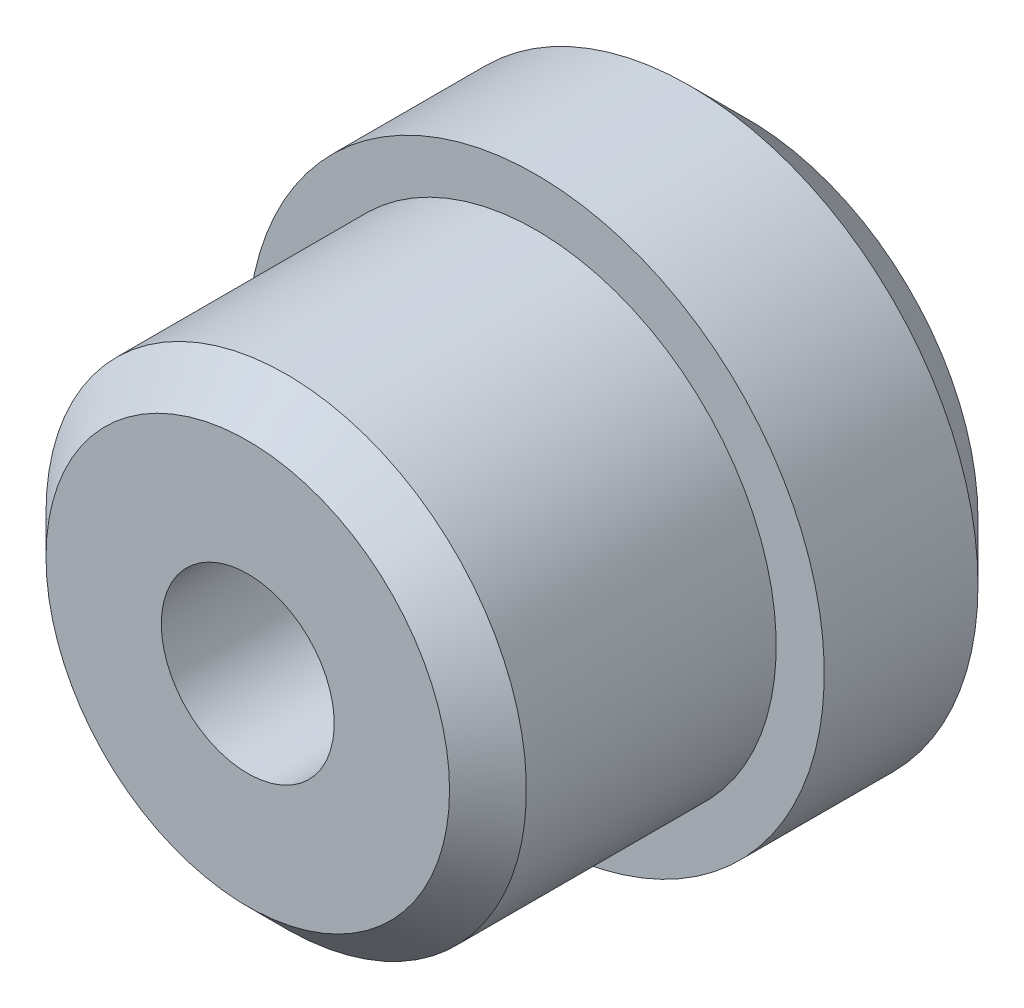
ISO-10303-21;
HEADER;
FILE_DESCRIPTION(('STEP AP214'),'2;1');
FILE_NAME('part.step','',(''),(''),'','','');
FILE_SCHEMA(('AUTOMOTIVE_DESIGN { 1 0 10303 214 1 1 1 1 }'));
ENDSEC;
DATA;
#1=APPLICATION_CONTEXT('core data for automotive mechanical design processes');
#2=APPLICATION_PROTOCOL_DEFINITION('international standard','automotive_design',2000,#1);
#3=PRODUCT_CONTEXT('',#1,'mechanical');
#4=PRODUCT('Part','Part','',(#3));
#5=PRODUCT_RELATED_PRODUCT_CATEGORY('part','',(#4));
#6=PRODUCT_DEFINITION_FORMATION('','',#4);
#7=PRODUCT_DEFINITION_CONTEXT('part definition',#1,'design');
#8=PRODUCT_DEFINITION('design','',#6,#7);
#9=PRODUCT_DEFINITION_SHAPE('','',#8);
#10=(LENGTH_UNIT() NAMED_UNIT(*) SI_UNIT(.MILLI.,.METRE.));
#11=(NAMED_UNIT(*) PLANE_ANGLE_UNIT() SI_UNIT($,.RADIAN.));
#12=(NAMED_UNIT(*) SI_UNIT($,.STERADIAN.) SOLID_ANGLE_UNIT());
#13=UNCERTAINTY_MEASURE_WITH_UNIT(LENGTH_MEASURE(1.E-05),#10,'distance_accuracy_value','');
#14=(GEOMETRIC_REPRESENTATION_CONTEXT(3) GLOBAL_UNCERTAINTY_ASSIGNED_CONTEXT((#13)) GLOBAL_UNIT_ASSIGNED_CONTEXT((#10,
#11,#12)) REPRESENTATION_CONTEXT('',''));
#15=CARTESIAN_POINT('',(0.,0.,0.));
#16=DIRECTION('',(0.,0.,1.));
#17=DIRECTION('',(1.,0.,0.));
#18=AXIS2_PLACEMENT_3D('',#15,#16,#17);
#19=CARTESIAN_POINT('',(0.,-2.55351295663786E-12,26.));
#20=DIRECTION('',(0.,0.,-1.));
#21=DIRECTION('',(-1.,0.,0.));
#22=AXIS2_PLACEMENT_3D('',#19,#20,#21);
#23=CYLINDRICAL_SURFACE('',#22,12.5);
#24=CARTESIAN_POINT('',(0.,-2.66453525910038E-12,24.));
#25=DIRECTION('',(0.,0.,1.));
#26=DIRECTION('',(1.,0.,0.));
#27=AXIS2_PLACEMENT_3D('',#24,#25,#26);
#28=CIRCLE('',#27,12.5);
#29=CARTESIAN_POINT('',(-12.5,-2.55281906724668E-12,24.));
#30=VERTEX_POINT('',#29);
#31=EDGE_CURVE('E49',#30,#30,#28,.F.);
#32=CARTESIAN_POINT('',(0.,-2.66453525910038E-12,11.));
#33=DIRECTION('',(0.,0.,-1.));
#34=DIRECTION('',(-1.,0.,0.));
#35=AXIS2_PLACEMENT_3D('',#32,#33,#34);
#36=CIRCLE('',#35,12.5);
#37=CARTESIAN_POINT('',(-12.5,-2.55281906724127E-12,11.));
#38=VERTEX_POINT('',#37);
#39=EDGE_CURVE('E45',#38,#38,#36,.T.);
#40=CARTESIAN_POINT('',(-12.5,-2.55281906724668E-12,24.));
#41=CARTESIAN_POINT('',(-12.5,-2.55281906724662E-12,23.8645833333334));
#42=CARTESIAN_POINT('',(-12.5,-2.55281906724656E-12,23.7291666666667));
#43=CARTESIAN_POINT('',(-12.5,-2.55281906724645E-12,23.4583333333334));
#44=CARTESIAN_POINT('',(-12.5,-2.5528190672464E-12,23.3229166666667));
#45=CARTESIAN_POINT('',(-12.5,-2.55281906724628E-12,23.0520833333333));
#46=CARTESIAN_POINT('',(-12.5,-2.55281906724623E-12,22.9166666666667));
#47=CARTESIAN_POINT('',(-12.5,-2.55281906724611E-12,22.6458333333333));
#48=CARTESIAN_POINT('',(-12.5,-2.55281906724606E-12,22.5104166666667));
#49=CARTESIAN_POINT('',(-12.5,-2.55281906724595E-12,22.2395833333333));
#50=CARTESIAN_POINT('',(-12.5,-2.55281906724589E-12,22.1041666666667));
#51=CARTESIAN_POINT('',(-12.5,-2.55281906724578E-12,21.8333333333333));
#52=CARTESIAN_POINT('',(-12.5,-2.55281906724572E-12,21.6979166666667));
#53=CARTESIAN_POINT('',(-12.5,-2.55281906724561E-12,21.4270833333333));
#54=CARTESIAN_POINT('',(-12.5,-2.55281906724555E-12,21.2916666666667));
#55=CARTESIAN_POINT('',(-12.5,-2.55281906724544E-12,21.0208333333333));
#56=CARTESIAN_POINT('',(-12.5,-2.55281906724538E-12,20.8854166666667));
#57=CARTESIAN_POINT('',(-12.5,-2.55281906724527E-12,20.6145833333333));
#58=CARTESIAN_POINT('',(-12.5,-2.55281906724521E-12,20.4791666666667));
#59=CARTESIAN_POINT('',(-12.5,-2.5528190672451E-12,20.2083333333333));
#60=CARTESIAN_POINT('',(-12.5,-2.55281906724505E-12,20.0729166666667));
#61=CARTESIAN_POINT('',(-12.5,-2.55281906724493E-12,19.8020833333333));
#62=CARTESIAN_POINT('',(-12.5,-2.55281906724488E-12,19.6666666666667));
#63=CARTESIAN_POINT('',(-12.5,-2.55281906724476E-12,19.3958333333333));
#64=CARTESIAN_POINT('',(-12.5,-2.55281906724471E-12,19.2604166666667));
#65=CARTESIAN_POINT('',(-12.5,-2.55281906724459E-12,18.9895833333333));
#66=CARTESIAN_POINT('',(-12.5,-2.55281906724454E-12,18.8541666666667));
#67=CARTESIAN_POINT('',(-12.5,-2.55281906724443E-12,18.5833333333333));
#68=CARTESIAN_POINT('',(-12.5,-2.55281906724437E-12,18.4479166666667));
#69=CARTESIAN_POINT('',(-12.5,-2.55281906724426E-12,18.1770833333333));
#70=CARTESIAN_POINT('',(-12.5,-2.5528190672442E-12,18.0416666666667));
#71=CARTESIAN_POINT('',(-12.5,-2.55281906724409E-12,17.7708333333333));
#72=CARTESIAN_POINT('',(-12.5,-2.55281906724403E-12,17.6354166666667));
#73=CARTESIAN_POINT('',(-12.5,-2.55281906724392E-12,17.3645833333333));
#74=CARTESIAN_POINT('',(-12.5,-2.55281906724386E-12,17.2291666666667));
#75=CARTESIAN_POINT('',(-12.5,-2.55281906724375E-12,16.9583333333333));
#76=CARTESIAN_POINT('',(-12.5,-2.55281906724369E-12,16.8229166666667));
#77=CARTESIAN_POINT('',(-12.5,-2.55281906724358E-12,16.5520833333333));
#78=CARTESIAN_POINT('',(-12.5,-2.55281906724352E-12,16.4166666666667));
#79=CARTESIAN_POINT('',(-12.5,-2.55281906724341E-12,16.1458333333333));
#80=CARTESIAN_POINT('',(-12.5,-2.55281906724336E-12,16.0104166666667));
#81=CARTESIAN_POINT('',(-12.5,-2.55281906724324E-12,15.7395833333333));
#82=CARTESIAN_POINT('',(-12.5,-2.55281906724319E-12,15.6041666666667));
#83=CARTESIAN_POINT('',(-12.5,-2.55281906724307E-12,15.3333333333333));
#84=CARTESIAN_POINT('',(-12.5,-2.55281906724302E-12,15.1979166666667));
#85=CARTESIAN_POINT('',(-12.5,-2.55281906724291E-12,14.9270833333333));
#86=CARTESIAN_POINT('',(-12.5,-2.55281906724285E-12,14.7916666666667));
#87=CARTESIAN_POINT('',(-12.5,-2.55281906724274E-12,14.5208333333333));
#88=CARTESIAN_POINT('',(-12.5,-2.55281906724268E-12,14.3854166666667));
#89=CARTESIAN_POINT('',(-12.5,-2.55281906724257E-12,14.1145833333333));
#90=CARTESIAN_POINT('',(-12.5,-2.55281906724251E-12,13.9791666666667));
#91=CARTESIAN_POINT('',(-12.5,-2.5528190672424E-12,13.7083333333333));
#92=CARTESIAN_POINT('',(-12.5,-2.55281906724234E-12,13.5729166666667));
#93=CARTESIAN_POINT('',(-12.5,-2.55281906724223E-12,13.3020833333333));
#94=CARTESIAN_POINT('',(-12.5,-2.55281906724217E-12,13.1666666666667));
#95=CARTESIAN_POINT('',(-12.5,-2.55281906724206E-12,12.8958333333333));
#96=CARTESIAN_POINT('',(-12.5,-2.552819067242E-12,12.7604166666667));
#97=CARTESIAN_POINT('',(-12.5,-2.55281906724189E-12,12.4895833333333));
#98=CARTESIAN_POINT('',(-12.5,-2.55281906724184E-12,12.3541666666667));
#99=CARTESIAN_POINT('',(-12.5,-2.55281906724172E-12,12.0833333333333));
#100=CARTESIAN_POINT('',(-12.5,-2.55281906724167E-12,11.9479166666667));
#101=CARTESIAN_POINT('',(-12.5,-2.55281906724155E-12,11.6770833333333));
#102=CARTESIAN_POINT('',(-12.5,-2.5528190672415E-12,11.5416666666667));
#103=CARTESIAN_POINT('',(-12.5,-2.55281906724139E-12,11.2708333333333));
#104=CARTESIAN_POINT('',(-12.5,-2.55281906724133E-12,11.1354166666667));
#105=CARTESIAN_POINT('',(-12.5,-2.55281906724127E-12,11.));
#106=B_SPLINE_CURVE_WITH_KNOTS('',3,(#40,#41,#42,#43,#44,#45,#46,#47,#48,#49,#50,#51,#52,#53,
#54,#55,#56,#57,#58,#59,#60,#61,#62,#63,#64,#65,#66,#67,#68,#69,#70,#71,#72,#73,#74,#75,#76,#77,
#78,#79,#80,#81,#82,#83,#84,#85,#86,#87,#88,#89,#90,#91,#92,#93,#94,#95,#96,#97,#98,#99,#100,
#101,#102,#103,#104,#105),.UNSPECIFIED.,.F.,.F.,(4,2,2,2,2,2,2,2,2,2,2,2,2,2,2,2,2,2,2,2,2,2,2,
2,2,2,2,2,2,2,2,2,4),(0.,0.40625,0.812500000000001,1.21875,1.625,2.03125,2.4375,2.84375,3.25,
3.65625,4.0625,4.46875,4.875,5.28125,5.6875,6.09375000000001,6.5,6.90625000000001,7.3125,
7.71875000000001,8.125,8.53125000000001,8.93750000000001,9.34375000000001,9.75000000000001,
10.15625,10.5625,10.96875,11.375,11.78125,12.1875,12.59375,13.),.UNSPECIFIED.);
#107=EDGE_CURVE('BSEAM34',#30,#38,#106,.T.);
#108=ORIENTED_EDGE('',*,*,#31,.T.);
#109=ORIENTED_EDGE('',*,*,#39,.F.);
#110=ORIENTED_EDGE('',*,*,#107,.T.);
#111=ORIENTED_EDGE('',*,*,#107,.F.);
#112=EDGE_LOOP('',(#108,#110,#109,#111));
#113=FACE_BOUND('',#112,.T.);
#114=ADVANCED_FACE('F34',(#113),#23,.T.);
#115=CARTESIAN_POINT('',(0.,-2.55351295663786E-12,26.));
#116=DIRECTION('',(0.,0.,1.));
#117=DIRECTION('',(1.,0.,0.));
#118=AXIS2_PLACEMENT_3D('',#115,#116,#117);
#119=PLANE('',#118);
#120=CARTESIAN_POINT('',(0.,-2.55351295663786E-12,26.));
#121=DIRECTION('',(0.,0.,-1.));
#122=DIRECTION('',(-1.,0.,0.));
#123=AXIS2_PLACEMENT_3D('',#120,#121,#122);
#124=CIRCLE('',#123,4.49999999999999);
#125=CARTESIAN_POINT('',(-4.5,-2.55326315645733E-12,26.));
#126=VERTEX_POINT('',#125);
#127=EDGE_CURVE('E66',#126,#126,#124,.T.);
#128=ORIENTED_EDGE('',*,*,#127,.T.);
#129=EDGE_LOOP('',(#128));
#130=FACE_BOUND('',#129,.T.);
#131=CARTESIAN_POINT('',(0.,-2.55351295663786E-12,26.));
#132=DIRECTION('',(0.,0.,1.));
#133=DIRECTION('',(1.,0.,0.));
#134=AXIS2_PLACEMENT_3D('',#131,#132,#133);
#135=CIRCLE('',#134,10.5);
#136=CARTESIAN_POINT('',(10.5,-2.55409582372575E-12,26.));
#137=VERTEX_POINT('',#136);
#138=EDGE_CURVE('E54',#137,#137,#135,.T.);
#139=ORIENTED_EDGE('',*,*,#138,.T.);
#140=EDGE_LOOP('',(#139));
#141=FACE_BOUND('',#140,.T.);
#142=ADVANCED_FACE('F87',(#130,#141),#119,.T.);
#143=CARTESIAN_POINT('',(0.,0.,0.));
#144=DIRECTION('',(0.,0.,1.));
#145=DIRECTION('',(1.,0.,0.));
#146=AXIS2_PLACEMENT_3D('',#143,#144,#145);
#147=PLANE('',#146);
#148=CARTESIAN_POINT('',(0.,0.,0.));
#149=DIRECTION('',(0.,0.,1.));
#150=DIRECTION('',(1.,0.,0.));
#151=AXIS2_PLACEMENT_3D('',#148,#149,#150);
#152=CIRCLE('',#151,12.);
#153=CARTESIAN_POINT('',(12.,0.,0.));
#154=VERTEX_POINT('',#153);
#155=EDGE_CURVE('E41',#154,#154,#152,.F.);
#156=ORIENTED_EDGE('',*,*,#155,.T.);
#157=EDGE_LOOP('',(#156));
#158=FACE_BOUND('',#157,.T.);
#159=CARTESIAN_POINT('',(0.,0.,0.));
#160=DIRECTION('',(0.,0.,-1.));
#161=DIRECTION('',(-1.,0.,0.));
#162=AXIS2_PLACEMENT_3D('',#159,#160,#161);
#163=CIRCLE('',#162,7.5);
#164=CARTESIAN_POINT('',(-7.50000000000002,0.,0.));
#165=VERTEX_POINT('',#164);
#166=EDGE_CURVE('E57',#165,#165,#163,.T.);
#167=ORIENTED_EDGE('',*,*,#166,.F.);
#168=EDGE_LOOP('',(#167));
#169=FACE_BOUND('',#168,.T.);
#170=ADVANCED_FACE('F93',(#158,#169),#147,.F.);
#171=CARTESIAN_POINT('',(0.,-2.55351295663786E-12,26.));
#172=DIRECTION('',(0.,0.,-1.));
#173=DIRECTION('',(-1.,0.,0.));
#174=AXIS2_PLACEMENT_3D('',#171,#172,#173);
#175=CONICAL_SURFACE('',#174,10.5,0.785398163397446);
#176=ORIENTED_EDGE('',*,*,#31,.F.);
#177=EDGE_LOOP('',(#176));
#178=FACE_BOUND('',#177,.T.);
#179=ORIENTED_EDGE('',*,*,#138,.F.);
#180=EDGE_LOOP('',(#179));
#181=FACE_BOUND('',#180,.T.);
#182=ADVANCED_FACE('F98',(#178,#181),#175,.T.);
#183=CARTESIAN_POINT('',(0.,0.,0.));
#184=DIRECTION('',(0.,0.,-1.));
#185=DIRECTION('',(-1.,0.,0.));
#186=AXIS2_PLACEMENT_3D('',#183,#184,#185);
#187=CYLINDRICAL_SURFACE('',#186,7.5);
#188=CARTESIAN_POINT('',(0.,-2.55351295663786E-12,13.));
#189=DIRECTION('',(0.,0.,-1.));
#190=DIRECTION('',(-1.,0.,0.));
#191=AXIS2_PLACEMENT_3D('',#188,#189,#190);
#192=CIRCLE('',#191,7.5);
#193=CARTESIAN_POINT('',(-7.50000000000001,-2.55309662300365E-12,13.));
#194=VERTEX_POINT('',#193);
#195=EDGE_CURVE('E60',#194,#194,#192,.T.);
#196=ORIENTED_EDGE('',*,*,#195,.F.);
#197=EDGE_LOOP('',(#196));
#198=FACE_BOUND('',#197,.T.);
#199=ORIENTED_EDGE('',*,*,#166,.T.);
#200=EDGE_LOOP('',(#199));
#201=FACE_BOUND('',#200,.T.);
#202=ADVANCED_FACE('F100',(#198,#201),#187,.F.);
#203=CARTESIAN_POINT('',(4.50000000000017,-4.21884749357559E-12,13.0000000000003));
#204=DIRECTION('',(0.,0.,1.));
#205=DIRECTION('',(1.,0.,0.));
#206=AXIS2_PLACEMENT_3D('',#203,#204,#205);
#207=PLANE('',#206);
#208=CARTESIAN_POINT('',(0.,-2.55351295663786E-12,13.));
#209=DIRECTION('',(0.,0.,-1.));
#210=DIRECTION('',(-1.,0.,0.));
#211=AXIS2_PLACEMENT_3D('',#208,#209,#210);
#212=CIRCLE('',#211,4.5);
#213=CARTESIAN_POINT('',(-4.50000000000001,-2.55326315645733E-12,13.));
#214=VERTEX_POINT('',#213);
#215=EDGE_CURVE('E63',#214,#214,#212,.T.);
#216=ORIENTED_EDGE('',*,*,#215,.F.);
#217=EDGE_LOOP('',(#216));
#218=FACE_BOUND('',#217,.T.);
#219=ORIENTED_EDGE('',*,*,#195,.T.);
#220=EDGE_LOOP('',(#219));
#221=FACE_BOUND('',#220,.T.);
#222=ADVANCED_FACE('F106',(#218,#221),#207,.F.);
#223=CARTESIAN_POINT('',(0.,0.,0.));
#224=DIRECTION('',(0.,0.,-1.));
#225=DIRECTION('',(-1.,0.,0.));
#226=AXIS2_PLACEMENT_3D('',#223,#224,#225);
#227=CYLINDRICAL_SURFACE('',#226,4.5);
#228=ORIENTED_EDGE('',*,*,#127,.F.);
#229=EDGE_LOOP('',(#228));
#230=FACE_BOUND('',#229,.T.);
#231=ORIENTED_EDGE('',*,*,#215,.T.);
#232=EDGE_LOOP('',(#231));
#233=FACE_BOUND('',#232,.T.);
#234=ADVANCED_FACE('F84',(#230,#233),#227,.F.);
#235=CARTESIAN_POINT('',(0.,-2.66453525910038E-12,11.));
#236=DIRECTION('',(0.,0.,-1.));
#237=DIRECTION('',(-1.,0.,0.));
#238=AXIS2_PLACEMENT_3D('',#235,#236,#237);
#239=CYLINDRICAL_SURFACE('',#238,15.);
#240=CARTESIAN_POINT('',(0.,-1.77635683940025E-12,3.));
#241=DIRECTION('',(0.,0.,1.));
#242=DIRECTION('',(1.,0.,0.));
#243=AXIS2_PLACEMENT_3D('',#240,#241,#242);
#244=CIRCLE('',#243,15.);
#245=CARTESIAN_POINT('',(15.,-1.77718950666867E-12,3.));
#246=VERTEX_POINT('',#245);
#247=EDGE_CURVE('E10',#246,#246,#244,.T.);
#248=ORIENTED_EDGE('',*,*,#247,.T.);
#249=EDGE_LOOP('',(#248));
#250=FACE_BOUND('',#249,.T.);
#251=CARTESIAN_POINT('',(0.,-2.66453525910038E-12,11.));
#252=DIRECTION('',(0.,0.,-1.));
#253=DIRECTION('',(-1.,0.,0.));
#254=AXIS2_PLACEMENT_3D('',#251,#252,#253);
#255=CIRCLE('',#254,15.);
#256=CARTESIAN_POINT('',(-15.,-2.66370259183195E-12,11.));
#257=VERTEX_POINT('',#256);
#258=EDGE_CURVE('E69',#257,#257,#255,.T.);
#259=ORIENTED_EDGE('',*,*,#258,.T.);
#260=EDGE_LOOP('',(#259));
#261=FACE_BOUND('',#260,.T.);
#262=ADVANCED_FACE('F73',(#250,#261),#239,.T.);
#263=CARTESIAN_POINT('',(0.,-2.66453525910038E-12,11.));
#264=DIRECTION('',(0.,0.,-1.));
#265=DIRECTION('',(-1.,0.,0.));
#266=AXIS2_PLACEMENT_3D('',#263,#264,#265);
#267=PLANE('',#266);
#268=ORIENTED_EDGE('',*,*,#39,.T.);
#269=EDGE_LOOP('',(#268));
#270=FACE_BOUND('',#269,.T.);
#271=ORIENTED_EDGE('',*,*,#258,.F.);
#272=EDGE_LOOP('',(#271));
#273=FACE_BOUND('',#272,.T.);
#274=ADVANCED_FACE('F75',(#270,#273),#267,.F.);
#275=CARTESIAN_POINT('',(0.,0.,0.));
#276=DIRECTION('',(0.,0.,1.));
#277=DIRECTION('',(1.,0.,0.));
#278=AXIS2_PLACEMENT_3D('',#275,#276,#277);
#279=CONICAL_SURFACE('',#278,12.,0.785398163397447);
#280=ORIENTED_EDGE('',*,*,#247,.F.);
#281=EDGE_LOOP('',(#280));
#282=FACE_BOUND('',#281,.T.);
#283=ORIENTED_EDGE('',*,*,#155,.F.);
#284=EDGE_LOOP('',(#283));
#285=FACE_BOUND('',#284,.T.);
#286=ADVANCED_FACE('F36',(#282,#285),#279,.T.);
#287=CLOSED_SHELL('',(#114,#142,#170,#182,#202,#222,#234,#262,#274,#286));
#288=MANIFOLD_SOLID_BREP('B2',#287);
#289=ADVANCED_BREP_SHAPE_REPRESENTATION('',(#18,#288),#14);
#290=SHAPE_DEFINITION_REPRESENTATION(#9,#289);
ENDSEC;
END-ISO-10303-21;
